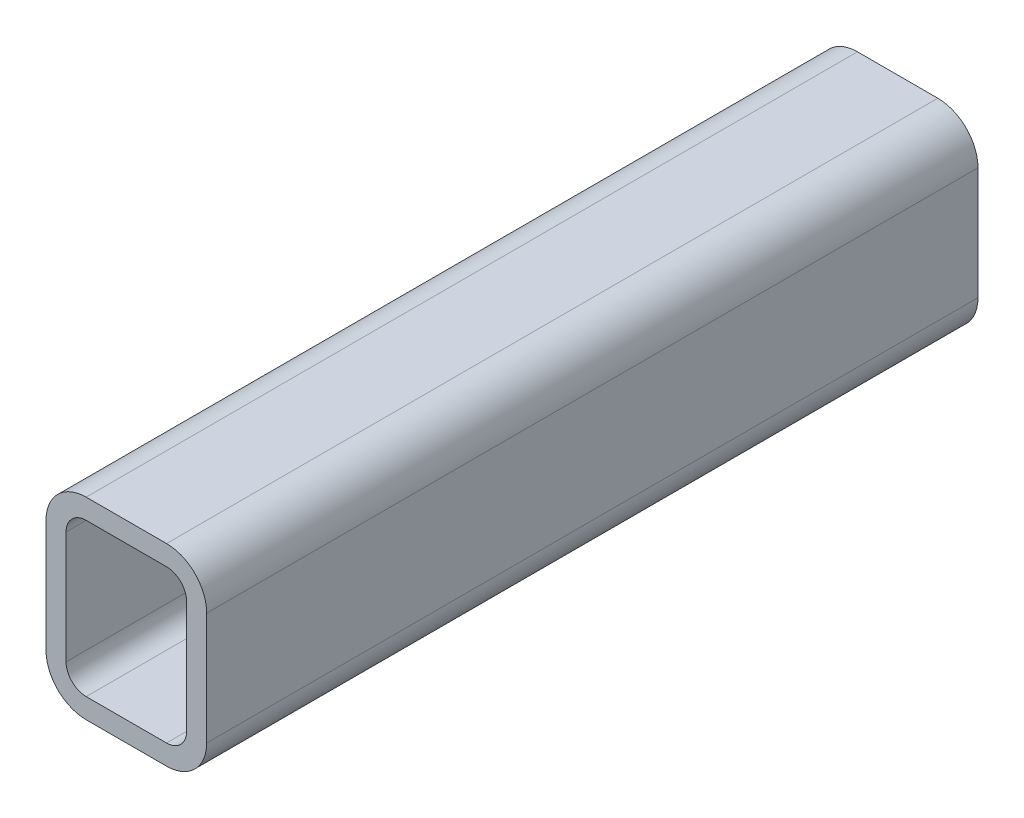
ISO-10303-21;
HEADER;
FILE_DESCRIPTION(('STEP AP214'),'2;1');
FILE_NAME('part.step','',(''),(''),'','','');
FILE_SCHEMA(('AUTOMOTIVE_DESIGN { 1 0 10303 214 1 1 1 1 }'));
ENDSEC;
DATA;
#1=APPLICATION_CONTEXT('core data for automotive mechanical design processes');
#2=APPLICATION_PROTOCOL_DEFINITION('international standard','automotive_design',2000,#1);
#3=PRODUCT_CONTEXT('',#1,'mechanical');
#4=PRODUCT('Part','Part','',(#3));
#5=PRODUCT_RELATED_PRODUCT_CATEGORY('part','',(#4));
#6=PRODUCT_DEFINITION_FORMATION('','',#4);
#7=PRODUCT_DEFINITION_CONTEXT('part definition',#1,'design');
#8=PRODUCT_DEFINITION('design','',#6,#7);
#9=PRODUCT_DEFINITION_SHAPE('','',#8);
#10=(LENGTH_UNIT() NAMED_UNIT(*) SI_UNIT(.MILLI.,.METRE.));
#11=(NAMED_UNIT(*) PLANE_ANGLE_UNIT() SI_UNIT($,.RADIAN.));
#12=(NAMED_UNIT(*) SI_UNIT($,.STERADIAN.) SOLID_ANGLE_UNIT());
#13=UNCERTAINTY_MEASURE_WITH_UNIT(LENGTH_MEASURE(1.E-05),#10,'distance_accuracy_value','');
#14=(GEOMETRIC_REPRESENTATION_CONTEXT(3) GLOBAL_UNCERTAINTY_ASSIGNED_CONTEXT((#13)) GLOBAL_UNIT_ASSIGNED_CONTEXT((#10,
#11,#12)) REPRESENTATION_CONTEXT('',''));
#15=CARTESIAN_POINT('',(0.,0.,0.));
#16=DIRECTION('',(0.,0.,1.));
#17=DIRECTION('',(1.,0.,0.));
#18=AXIS2_PLACEMENT_3D('',#15,#16,#17);
#19=CARTESIAN_POINT('',(18.7710851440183,62.4056737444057,304.8));
#20=DIRECTION('',(0.,0.,1.));
#21=DIRECTION('',(1.,0.,0.));
#22=AXIS2_PLACEMENT_3D('',#19,#20,#21);
#23=PLANE('',#22);
#24=CARTESIAN_POINT('',(18.7710851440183,62.4056737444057,304.8));
#25=DIRECTION('',(0.,0.,1.));
#26=DIRECTION('',(1.,0.,0.));
#27=AXIS2_PLACEMENT_3D('',#24,#25,#26);
#28=CIRCLE('',#27,15.875);
#29=CARTESIAN_POINT('',(18.7710851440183,78.2806737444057,304.8));
#30=VERTEX_POINT('',#29);
#31=CARTESIAN_POINT('',(2.89608514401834,62.4056737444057,304.8));
#32=VERTEX_POINT('',#31);
#33=EDGE_CURVE('E211',#30,#32,#28,.T.);
#34=ORIENTED_EDGE('',*,*,#33,.T.);
#35=DIRECTION('',(0.,-1.,0.));
#36=VECTOR('',#35,1.);
#37=CARTESIAN_POINT('',(2.89608514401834,17.9556737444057,304.8));
#38=LINE('',#37,#36);
#39=CARTESIAN_POINT('',(2.89608514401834,17.9556737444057,304.8));
#40=VERTEX_POINT('',#39);
#41=EDGE_CURVE('E214',#32,#40,#38,.T.);
#42=ORIENTED_EDGE('',*,*,#41,.T.);
#43=CARTESIAN_POINT('',(18.7710851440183,17.9556737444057,304.8));
#44=DIRECTION('',(0.,0.,1.));
#45=DIRECTION('',(1.,0.,0.));
#46=AXIS2_PLACEMENT_3D('',#43,#44,#45);
#47=CIRCLE('',#46,15.875);
#48=CARTESIAN_POINT('',(18.7710851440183,2.0806737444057,304.8));
#49=VERTEX_POINT('',#48);
#50=EDGE_CURVE('E217',#40,#49,#47,.T.);
#51=ORIENTED_EDGE('',*,*,#50,.T.);
#52=DIRECTION('',(1.,0.,0.));
#53=VECTOR('',#52,1.);
#54=CARTESIAN_POINT('',(50.5210851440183,2.0806737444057,304.8));
#55=LINE('',#54,#53);
#56=CARTESIAN_POINT('',(50.5210851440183,2.0806737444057,304.8));
#57=VERTEX_POINT('',#56);
#58=EDGE_CURVE('E219',#49,#57,#55,.T.);
#59=ORIENTED_EDGE('',*,*,#58,.T.);
#60=CARTESIAN_POINT('',(50.5210851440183,17.9556737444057,304.8));
#61=DIRECTION('',(0.,0.,1.));
#62=DIRECTION('',(1.,0.,0.));
#63=AXIS2_PLACEMENT_3D('',#60,#61,#62);
#64=CIRCLE('',#63,15.875);
#65=CARTESIAN_POINT('',(66.3960851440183,17.9556737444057,304.8));
#66=VERTEX_POINT('',#65);
#67=EDGE_CURVE('E221',#57,#66,#64,.T.);
#68=ORIENTED_EDGE('',*,*,#67,.T.);
#69=DIRECTION('',(0.,1.,0.));
#70=VECTOR('',#69,1.);
#71=CARTESIAN_POINT('',(66.3960851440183,62.4056737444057,304.8));
#72=LINE('',#71,#70);
#73=CARTESIAN_POINT('',(66.3960851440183,62.4056737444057,304.8));
#74=VERTEX_POINT('',#73);
#75=EDGE_CURVE('E223',#66,#74,#72,.T.);
#76=ORIENTED_EDGE('',*,*,#75,.T.);
#77=CARTESIAN_POINT('',(50.5210851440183,62.4056737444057,304.8));
#78=DIRECTION('',(0.,0.,1.));
#79=DIRECTION('',(1.,0.,0.));
#80=AXIS2_PLACEMENT_3D('',#77,#78,#79);
#81=CIRCLE('',#80,15.875);
#82=CARTESIAN_POINT('',(50.5210851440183,78.2806737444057,304.8));
#83=VERTEX_POINT('',#82);
#84=EDGE_CURVE('E225',#74,#83,#81,.T.);
#85=ORIENTED_EDGE('',*,*,#84,.T.);
#86=DIRECTION('',(-1.,0.,0.));
#87=VECTOR('',#86,1.);
#88=CARTESIAN_POINT('',(18.7710851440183,78.2806737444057,304.8));
#89=LINE('',#88,#87);
#90=EDGE_CURVE('E227',#83,#30,#89,.T.);
#91=ORIENTED_EDGE('',*,*,#90,.T.);
#92=EDGE_LOOP('',(#34,#42,#51,#59,#68,#76,#85,#91));
#93=FACE_BOUND('',#92,.T.);
#94=DIRECTION('',(0.,-1.,0.));
#95=VECTOR('',#94,1.);
#96=CARTESIAN_POINT('',(10.8335851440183,17.9556737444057,304.8));
#97=LINE('',#96,#95);
#98=CARTESIAN_POINT('',(10.8335851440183,62.4056737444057,304.8));
#99=VERTEX_POINT('',#98);
#100=CARTESIAN_POINT('',(10.8335851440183,17.9556737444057,304.8));
#101=VERTEX_POINT('',#100);
#102=EDGE_CURVE('E154',#99,#101,#97,.T.);
#103=ORIENTED_EDGE('',*,*,#102,.F.);
#104=CARTESIAN_POINT('',(18.7710851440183,62.4056737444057,304.8));
#105=DIRECTION('',(0.,0.,1.));
#106=DIRECTION('',(1.,0.,0.));
#107=AXIS2_PLACEMENT_3D('',#104,#105,#106);
#108=CIRCLE('',#107,7.9375);
#109=CARTESIAN_POINT('',(18.7710851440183,70.3431737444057,304.8));
#110=VERTEX_POINT('',#109);
#111=EDGE_CURVE('E146',#110,#99,#108,.T.);
#112=ORIENTED_EDGE('',*,*,#111,.F.);
#113=DIRECTION('',(-1.,0.,0.));
#114=VECTOR('',#113,1.);
#115=CARTESIAN_POINT('',(18.7710851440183,70.3431737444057,304.8));
#116=LINE('',#115,#114);
#117=CARTESIAN_POINT('',(50.5210851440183,70.3431737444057,304.8));
#118=VERTEX_POINT('',#117);
#119=EDGE_CURVE('E179',#118,#110,#116,.T.);
#120=ORIENTED_EDGE('',*,*,#119,.F.);
#121=CARTESIAN_POINT('',(50.5210851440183,62.4056737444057,304.8));
#122=DIRECTION('',(0.,0.,1.));
#123=DIRECTION('',(1.,0.,0.));
#124=AXIS2_PLACEMENT_3D('',#121,#122,#123);
#125=CIRCLE('',#124,7.93750000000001);
#126=CARTESIAN_POINT('',(58.4585851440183,62.4056737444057,304.8));
#127=VERTEX_POINT('',#126);
#128=EDGE_CURVE('E177',#127,#118,#125,.T.);
#129=ORIENTED_EDGE('',*,*,#128,.F.);
#130=DIRECTION('',(0.,1.,0.));
#131=VECTOR('',#130,1.);
#132=CARTESIAN_POINT('',(58.4585851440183,62.4056737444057,304.8));
#133=LINE('',#132,#131);
#134=CARTESIAN_POINT('',(58.4585851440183,17.9556737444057,304.8));
#135=VERTEX_POINT('',#134);
#136=EDGE_CURVE('E175',#135,#127,#133,.T.);
#137=ORIENTED_EDGE('',*,*,#136,.F.);
#138=CARTESIAN_POINT('',(50.5210851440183,17.9556737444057,304.8));
#139=DIRECTION('',(0.,0.,1.));
#140=DIRECTION('',(1.,0.,0.));
#141=AXIS2_PLACEMENT_3D('',#138,#139,#140);
#142=CIRCLE('',#141,7.93750000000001);
#143=CARTESIAN_POINT('',(50.5210851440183,10.0181737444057,304.8));
#144=VERTEX_POINT('',#143);
#145=EDGE_CURVE('E173',#144,#135,#142,.T.);
#146=ORIENTED_EDGE('',*,*,#145,.F.);
#147=DIRECTION('',(1.,0.,0.));
#148=VECTOR('',#147,1.);
#149=CARTESIAN_POINT('',(50.5210851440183,10.0181737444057,304.8));
#150=LINE('',#149,#148);
#151=CARTESIAN_POINT('',(18.7710851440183,10.0181737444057,304.8));
#152=VERTEX_POINT('',#151);
#153=EDGE_CURVE('E169',#152,#144,#150,.T.);
#154=ORIENTED_EDGE('',*,*,#153,.F.);
#155=CARTESIAN_POINT('',(18.7710851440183,17.9556737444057,304.8));
#156=DIRECTION('',(0.,0.,1.));
#157=DIRECTION('',(1.,0.,0.));
#158=AXIS2_PLACEMENT_3D('',#155,#156,#157);
#159=CIRCLE('',#158,7.9375);
#160=EDGE_CURVE('E167',#101,#152,#159,.T.);
#161=ORIENTED_EDGE('',*,*,#160,.F.);
#162=EDGE_LOOP('',(#103,#112,#120,#129,#137,#146,#154,#161));
#163=FACE_BOUND('',#162,.T.);
#164=ADVANCED_FACE('F33',(#93,#163),#23,.T.);
#165=CARTESIAN_POINT('',(18.7710851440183,62.4056737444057,0.));
#166=DIRECTION('',(0.,0.,1.));
#167=DIRECTION('',(1.,0.,0.));
#168=AXIS2_PLACEMENT_3D('',#165,#166,#167);
#169=PLANE('',#168);
#170=CARTESIAN_POINT('',(18.7710851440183,62.4056737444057,0.));
#171=DIRECTION('',(0.,0.,1.));
#172=DIRECTION('',(1.,0.,0.));
#173=AXIS2_PLACEMENT_3D('',#170,#171,#172);
#174=CIRCLE('',#173,15.875);
#175=CARTESIAN_POINT('',(18.7710851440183,78.2806737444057,0.));
#176=VERTEX_POINT('',#175);
#177=CARTESIAN_POINT('',(2.89608514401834,62.4056737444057,0.));
#178=VERTEX_POINT('',#177);
#179=EDGE_CURVE('E162',#176,#178,#174,.T.);
#180=ORIENTED_EDGE('',*,*,#179,.F.);
#181=DIRECTION('',(-1.,0.,0.));
#182=VECTOR('',#181,1.);
#183=CARTESIAN_POINT('',(18.7710851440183,78.2806737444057,0.));
#184=LINE('',#183,#182);
#185=CARTESIAN_POINT('',(50.5210851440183,78.2806737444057,0.));
#186=VERTEX_POINT('',#185);
#187=EDGE_CURVE('E215',#186,#176,#184,.T.);
#188=ORIENTED_EDGE('',*,*,#187,.F.);
#189=CARTESIAN_POINT('',(50.5210851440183,62.4056737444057,0.));
#190=DIRECTION('',(0.,0.,1.));
#191=DIRECTION('',(1.,0.,0.));
#192=AXIS2_PLACEMENT_3D('',#189,#190,#191);
#193=CIRCLE('',#192,15.875);
#194=CARTESIAN_POINT('',(66.3960851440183,62.4056737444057,0.));
#195=VERTEX_POINT('',#194);
#196=EDGE_CURVE('E242',#195,#186,#193,.T.);
#197=ORIENTED_EDGE('',*,*,#196,.F.);
#198=DIRECTION('',(0.,1.,0.));
#199=VECTOR('',#198,1.);
#200=CARTESIAN_POINT('',(66.3960851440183,62.4056737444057,0.));
#201=LINE('',#200,#199);
#202=CARTESIAN_POINT('',(66.3960851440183,17.9556737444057,0.));
#203=VERTEX_POINT('',#202);
#204=EDGE_CURVE('E240',#203,#195,#201,.T.);
#205=ORIENTED_EDGE('',*,*,#204,.F.);
#206=CARTESIAN_POINT('',(50.5210851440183,17.9556737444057,0.));
#207=DIRECTION('',(0.,0.,1.));
#208=DIRECTION('',(1.,0.,0.));
#209=AXIS2_PLACEMENT_3D('',#206,#207,#208);
#210=CIRCLE('',#209,15.875);
#211=CARTESIAN_POINT('',(50.5210851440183,2.0806737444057,0.));
#212=VERTEX_POINT('',#211);
#213=EDGE_CURVE('E238',#212,#203,#210,.T.);
#214=ORIENTED_EDGE('',*,*,#213,.F.);
#215=DIRECTION('',(1.,0.,0.));
#216=VECTOR('',#215,1.);
#217=CARTESIAN_POINT('',(50.5210851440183,2.0806737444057,0.));
#218=LINE('',#217,#216);
#219=CARTESIAN_POINT('',(18.7710851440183,2.0806737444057,0.));
#220=VERTEX_POINT('',#219);
#221=EDGE_CURVE('E236',#220,#212,#218,.T.);
#222=ORIENTED_EDGE('',*,*,#221,.F.);
#223=CARTESIAN_POINT('',(18.7710851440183,17.9556737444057,0.));
#224=DIRECTION('',(0.,0.,1.));
#225=DIRECTION('',(1.,0.,0.));
#226=AXIS2_PLACEMENT_3D('',#223,#224,#225);
#227=CIRCLE('',#226,15.875);
#228=CARTESIAN_POINT('',(2.89608514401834,17.9556737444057,0.));
#229=VERTEX_POINT('',#228);
#230=EDGE_CURVE('E234',#229,#220,#227,.T.);
#231=ORIENTED_EDGE('',*,*,#230,.F.);
#232=DIRECTION('',(0.,-1.,0.));
#233=VECTOR('',#232,1.);
#234=CARTESIAN_POINT('',(2.89608514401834,17.9556737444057,0.));
#235=LINE('',#234,#233);
#236=EDGE_CURVE('E232',#178,#229,#235,.T.);
#237=ORIENTED_EDGE('',*,*,#236,.F.);
#238=EDGE_LOOP('',(#180,#188,#197,#205,#214,#222,#231,#237));
#239=FACE_BOUND('',#238,.T.);
#240=CARTESIAN_POINT('',(18.7710851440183,62.4056737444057,0.));
#241=DIRECTION('',(0.,0.,1.));
#242=DIRECTION('',(1.,0.,0.));
#243=AXIS2_PLACEMENT_3D('',#240,#241,#242);
#244=CIRCLE('',#243,7.9375);
#245=CARTESIAN_POINT('',(18.7710851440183,70.3431737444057,0.));
#246=VERTEX_POINT('',#245);
#247=CARTESIAN_POINT('',(10.8335851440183,62.4056737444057,0.));
#248=VERTEX_POINT('',#247);
#249=EDGE_CURVE('E56',#246,#248,#244,.T.);
#250=ORIENTED_EDGE('',*,*,#249,.T.);
#251=DIRECTION('',(0.,-1.,0.));
#252=VECTOR('',#251,1.);
#253=CARTESIAN_POINT('',(10.8335851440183,17.9556737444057,0.));
#254=LINE('',#253,#252);
#255=CARTESIAN_POINT('',(10.8335851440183,17.9556737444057,0.));
#256=VERTEX_POINT('',#255);
#257=EDGE_CURVE('E161',#248,#256,#254,.T.);
#258=ORIENTED_EDGE('',*,*,#257,.T.);
#259=CARTESIAN_POINT('',(18.7710851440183,17.9556737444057,0.));
#260=DIRECTION('',(0.,0.,1.));
#261=DIRECTION('',(1.,0.,0.));
#262=AXIS2_PLACEMENT_3D('',#259,#260,#261);
#263=CIRCLE('',#262,7.9375);
#264=CARTESIAN_POINT('',(18.7710851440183,10.0181737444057,0.));
#265=VERTEX_POINT('',#264);
#266=EDGE_CURVE('E183',#256,#265,#263,.T.);
#267=ORIENTED_EDGE('',*,*,#266,.T.);
#268=DIRECTION('',(1.,0.,0.));
#269=VECTOR('',#268,1.);
#270=CARTESIAN_POINT('',(50.5210851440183,10.0181737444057,0.));
#271=LINE('',#270,#269);
#272=CARTESIAN_POINT('',(50.5210851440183,10.0181737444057,0.));
#273=VERTEX_POINT('',#272);
#274=EDGE_CURVE('E186',#265,#273,#271,.T.);
#275=ORIENTED_EDGE('',*,*,#274,.T.);
#276=CARTESIAN_POINT('',(50.5210851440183,17.9556737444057,0.));
#277=DIRECTION('',(0.,0.,1.));
#278=DIRECTION('',(1.,0.,0.));
#279=AXIS2_PLACEMENT_3D('',#276,#277,#278);
#280=CIRCLE('',#279,7.93750000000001);
#281=CARTESIAN_POINT('',(58.4585851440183,17.9556737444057,0.));
#282=VERTEX_POINT('',#281);
#283=EDGE_CURVE('E189',#273,#282,#280,.T.);
#284=ORIENTED_EDGE('',*,*,#283,.T.);
#285=DIRECTION('',(0.,1.,0.));
#286=VECTOR('',#285,1.);
#287=CARTESIAN_POINT('',(58.4585851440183,62.4056737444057,0.));
#288=LINE('',#287,#286);
#289=CARTESIAN_POINT('',(58.4585851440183,62.4056737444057,0.));
#290=VERTEX_POINT('',#289);
#291=EDGE_CURVE('E192',#282,#290,#288,.T.);
#292=ORIENTED_EDGE('',*,*,#291,.T.);
#293=CARTESIAN_POINT('',(50.5210851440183,62.4056737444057,0.));
#294=DIRECTION('',(0.,0.,1.));
#295=DIRECTION('',(1.,0.,0.));
#296=AXIS2_PLACEMENT_3D('',#293,#294,#295);
#297=CIRCLE('',#296,7.93750000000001);
#298=CARTESIAN_POINT('',(50.5210851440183,70.3431737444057,0.));
#299=VERTEX_POINT('',#298);
#300=EDGE_CURVE('E195',#290,#299,#297,.T.);
#301=ORIENTED_EDGE('',*,*,#300,.T.);
#302=DIRECTION('',(-1.,0.,0.));
#303=VECTOR('',#302,1.);
#304=CARTESIAN_POINT('',(18.7710851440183,70.3431737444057,0.));
#305=LINE('',#304,#303);
#306=EDGE_CURVE('E155',#299,#246,#305,.T.);
#307=ORIENTED_EDGE('',*,*,#306,.T.);
#308=EDGE_LOOP('',(#250,#258,#267,#275,#284,#292,#301,#307));
#309=FACE_BOUND('',#308,.T.);
#310=ADVANCED_FACE('F272',(#239,#309),#169,.F.);
#311=CARTESIAN_POINT('',(18.7710851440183,62.4056737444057,304.8));
#312=DIRECTION('',(0.,0.,-1.));
#313=DIRECTION('',(-1.,0.,0.));
#314=AXIS2_PLACEMENT_3D('',#311,#312,#313);
#315=CYLINDRICAL_SURFACE('',#314,15.875);
#316=ORIENTED_EDGE('',*,*,#179,.T.);
#317=DIRECTION('',(0.,0.,-1.));
#318=VECTOR('',#317,1.);
#319=CARTESIAN_POINT('',(2.89608514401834,62.4056737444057,304.8));
#320=LINE('',#319,#318);
#321=EDGE_CURVE('E11',#32,#178,#320,.T.);
#322=ORIENTED_EDGE('',*,*,#321,.F.);
#323=ORIENTED_EDGE('',*,*,#33,.F.);
#324=DIRECTION('',(0.,0.,-1.));
#325=VECTOR('',#324,1.);
#326=CARTESIAN_POINT('',(18.7710851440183,78.2806737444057,304.8));
#327=LINE('',#326,#325);
#328=EDGE_CURVE('E229',#30,#176,#327,.T.);
#329=ORIENTED_EDGE('',*,*,#328,.T.);
#330=EDGE_LOOP('',(#316,#322,#323,#329));
#331=FACE_BOUND('',#330,.T.);
#332=ADVANCED_FACE('F35',(#331),#315,.T.);
#333=CARTESIAN_POINT('',(2.89608514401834,17.9556737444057,304.8));
#334=DIRECTION('',(1.,0.,0.));
#335=DIRECTION('',(0.,0.,-1.));
#336=AXIS2_PLACEMENT_3D('',#333,#334,#335);
#337=PLANE('',#336);
#338=ORIENTED_EDGE('',*,*,#236,.T.);
#339=DIRECTION('',(0.,0.,-1.));
#340=VECTOR('',#339,1.);
#341=CARTESIAN_POINT('',(2.89608514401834,17.9556737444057,304.8));
#342=LINE('',#341,#340);
#343=EDGE_CURVE('E41',#40,#229,#342,.T.);
#344=ORIENTED_EDGE('',*,*,#343,.F.);
#345=ORIENTED_EDGE('',*,*,#41,.F.);
#346=ORIENTED_EDGE('',*,*,#321,.T.);
#347=EDGE_LOOP('',(#338,#344,#345,#346));
#348=FACE_BOUND('',#347,.T.);
#349=ADVANCED_FACE('F289',(#348),#337,.F.);
#350=CARTESIAN_POINT('',(18.7710851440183,17.9556737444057,304.8));
#351=DIRECTION('',(0.,0.,-1.));
#352=DIRECTION('',(-1.,0.,0.));
#353=AXIS2_PLACEMENT_3D('',#350,#351,#352);
#354=CYLINDRICAL_SURFACE('',#353,15.875);
#355=ORIENTED_EDGE('',*,*,#230,.T.);
#356=DIRECTION('',(0.,0.,-1.));
#357=VECTOR('',#356,1.);
#358=CARTESIAN_POINT('',(18.7710851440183,2.0806737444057,304.8));
#359=LINE('',#358,#357);
#360=EDGE_CURVE('E259',#49,#220,#359,.T.);
#361=ORIENTED_EDGE('',*,*,#360,.F.);
#362=ORIENTED_EDGE('',*,*,#50,.F.);
#363=ORIENTED_EDGE('',*,*,#343,.T.);
#364=EDGE_LOOP('',(#355,#361,#362,#363));
#365=FACE_BOUND('',#364,.T.);
#366=ADVANCED_FACE('F266',(#365),#354,.T.);
#367=CARTESIAN_POINT('',(50.5210851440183,2.0806737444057,304.8));
#368=DIRECTION('',(0.,1.,0.));
#369=DIRECTION('',(0.,0.,1.));
#370=AXIS2_PLACEMENT_3D('',#367,#368,#369);
#371=PLANE('',#370);
#372=ORIENTED_EDGE('',*,*,#221,.T.);
#373=DIRECTION('',(0.,0.,-1.));
#374=VECTOR('',#373,1.);
#375=CARTESIAN_POINT('',(50.5210851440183,2.0806737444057,304.8));
#376=LINE('',#375,#374);
#377=EDGE_CURVE('E256',#57,#212,#376,.T.);
#378=ORIENTED_EDGE('',*,*,#377,.F.);
#379=ORIENTED_EDGE('',*,*,#58,.F.);
#380=ORIENTED_EDGE('',*,*,#360,.T.);
#381=EDGE_LOOP('',(#372,#378,#379,#380));
#382=FACE_BOUND('',#381,.T.);
#383=ADVANCED_FACE('F278',(#382),#371,.F.);
#384=CARTESIAN_POINT('',(50.5210851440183,17.9556737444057,304.8));
#385=DIRECTION('',(0.,0.,-1.));
#386=DIRECTION('',(-1.,0.,0.));
#387=AXIS2_PLACEMENT_3D('',#384,#385,#386);
#388=CYLINDRICAL_SURFACE('',#387,15.875);
#389=ORIENTED_EDGE('',*,*,#213,.T.);
#390=DIRECTION('',(0.,0.,-1.));
#391=VECTOR('',#390,1.);
#392=CARTESIAN_POINT('',(66.3960851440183,17.9556737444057,304.8));
#393=LINE('',#392,#391);
#394=EDGE_CURVE('E253',#66,#203,#393,.T.);
#395=ORIENTED_EDGE('',*,*,#394,.F.);
#396=ORIENTED_EDGE('',*,*,#67,.F.);
#397=ORIENTED_EDGE('',*,*,#377,.T.);
#398=EDGE_LOOP('',(#389,#395,#396,#397));
#399=FACE_BOUND('',#398,.T.);
#400=ADVANCED_FACE('F282',(#399),#388,.T.);
#401=CARTESIAN_POINT('',(66.3960851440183,62.4056737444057,304.8));
#402=DIRECTION('',(-1.,0.,0.));
#403=DIRECTION('',(0.,0.,1.));
#404=AXIS2_PLACEMENT_3D('',#401,#402,#403);
#405=PLANE('',#404);
#406=ORIENTED_EDGE('',*,*,#204,.T.);
#407=DIRECTION('',(0.,0.,-1.));
#408=VECTOR('',#407,1.);
#409=CARTESIAN_POINT('',(66.3960851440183,62.4056737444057,304.8));
#410=LINE('',#409,#408);
#411=EDGE_CURVE('E250',#74,#195,#410,.T.);
#412=ORIENTED_EDGE('',*,*,#411,.F.);
#413=ORIENTED_EDGE('',*,*,#75,.F.);
#414=ORIENTED_EDGE('',*,*,#394,.T.);
#415=EDGE_LOOP('',(#406,#412,#413,#414));
#416=FACE_BOUND('',#415,.T.);
#417=ADVANCED_FACE('F302',(#416),#405,.F.);
#418=CARTESIAN_POINT('',(50.5210851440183,62.4056737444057,304.8));
#419=DIRECTION('',(0.,0.,-1.));
#420=DIRECTION('',(-1.,0.,0.));
#421=AXIS2_PLACEMENT_3D('',#418,#419,#420);
#422=CYLINDRICAL_SURFACE('',#421,15.875);
#423=ORIENTED_EDGE('',*,*,#196,.T.);
#424=DIRECTION('',(0.,0.,-1.));
#425=VECTOR('',#424,1.);
#426=CARTESIAN_POINT('',(50.5210851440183,78.2806737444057,304.8));
#427=LINE('',#426,#425);
#428=EDGE_CURVE('E247',#83,#186,#427,.T.);
#429=ORIENTED_EDGE('',*,*,#428,.F.);
#430=ORIENTED_EDGE('',*,*,#84,.F.);
#431=ORIENTED_EDGE('',*,*,#411,.T.);
#432=EDGE_LOOP('',(#423,#429,#430,#431));
#433=FACE_BOUND('',#432,.T.);
#434=ADVANCED_FACE('F300',(#433),#422,.T.);
#435=CARTESIAN_POINT('',(18.7710851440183,78.2806737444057,304.8));
#436=DIRECTION('',(0.,-1.,0.));
#437=DIRECTION('',(0.,0.,-1.));
#438=AXIS2_PLACEMENT_3D('',#435,#436,#437);
#439=PLANE('',#438);
#440=ORIENTED_EDGE('',*,*,#187,.T.);
#441=ORIENTED_EDGE('',*,*,#328,.F.);
#442=ORIENTED_EDGE('',*,*,#90,.F.);
#443=ORIENTED_EDGE('',*,*,#428,.T.);
#444=EDGE_LOOP('',(#440,#441,#442,#443));
#445=FACE_BOUND('',#444,.T.);
#446=ADVANCED_FACE('F295',(#445),#439,.F.);
#447=CARTESIAN_POINT('',(18.7710851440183,62.4056737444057,304.8));
#448=DIRECTION('',(0.,0.,-1.));
#449=DIRECTION('',(-1.,0.,0.));
#450=AXIS2_PLACEMENT_3D('',#447,#448,#449);
#451=CYLINDRICAL_SURFACE('',#450,7.9375);
#452=ORIENTED_EDGE('',*,*,#249,.F.);
#453=DIRECTION('',(0.,0.,-1.));
#454=VECTOR('',#453,1.);
#455=CARTESIAN_POINT('',(18.7710851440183,70.3431737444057,304.8));
#456=LINE('',#455,#454);
#457=EDGE_CURVE('E150',#110,#246,#456,.T.);
#458=ORIENTED_EDGE('',*,*,#457,.F.);
#459=ORIENTED_EDGE('',*,*,#111,.T.);
#460=DIRECTION('',(0.,0.,-1.));
#461=VECTOR('',#460,1.);
#462=CARTESIAN_POINT('',(10.8335851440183,62.4056737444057,304.8));
#463=LINE('',#462,#461);
#464=EDGE_CURVE('E149',#99,#248,#463,.T.);
#465=ORIENTED_EDGE('',*,*,#464,.T.);
#466=EDGE_LOOP('',(#452,#458,#459,#465));
#467=FACE_BOUND('',#466,.T.);
#468=ADVANCED_FACE('F148',(#467),#451,.F.);
#469=CARTESIAN_POINT('',(10.8335851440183,17.9556737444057,304.8));
#470=DIRECTION('',(1.,0.,0.));
#471=DIRECTION('',(0.,0.,-1.));
#472=AXIS2_PLACEMENT_3D('',#469,#470,#471);
#473=PLANE('',#472);
#474=ORIENTED_EDGE('',*,*,#257,.F.);
#475=ORIENTED_EDGE('',*,*,#464,.F.);
#476=ORIENTED_EDGE('',*,*,#102,.T.);
#477=DIRECTION('',(0.,0.,-1.));
#478=VECTOR('',#477,1.);
#479=CARTESIAN_POINT('',(10.8335851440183,17.9556737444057,304.8));
#480=LINE('',#479,#478);
#481=EDGE_CURVE('E163',#101,#256,#480,.T.);
#482=ORIENTED_EDGE('',*,*,#481,.T.);
#483=EDGE_LOOP('',(#474,#475,#476,#482));
#484=FACE_BOUND('',#483,.T.);
#485=ADVANCED_FACE('F158',(#484),#473,.T.);
#486=CARTESIAN_POINT('',(18.7710851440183,17.9556737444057,304.8));
#487=DIRECTION('',(0.,0.,-1.));
#488=DIRECTION('',(-1.,0.,0.));
#489=AXIS2_PLACEMENT_3D('',#486,#487,#488);
#490=CYLINDRICAL_SURFACE('',#489,7.9375);
#491=ORIENTED_EDGE('',*,*,#266,.F.);
#492=ORIENTED_EDGE('',*,*,#481,.F.);
#493=ORIENTED_EDGE('',*,*,#160,.T.);
#494=DIRECTION('',(0.,0.,-1.));
#495=VECTOR('',#494,1.);
#496=CARTESIAN_POINT('',(18.7710851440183,10.0181737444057,304.8));
#497=LINE('',#496,#495);
#498=EDGE_CURVE('E208',#152,#265,#497,.T.);
#499=ORIENTED_EDGE('',*,*,#498,.T.);
#500=EDGE_LOOP('',(#491,#492,#493,#499));
#501=FACE_BOUND('',#500,.T.);
#502=ADVANCED_FACE('F327',(#501),#490,.F.);
#503=CARTESIAN_POINT('',(50.5210851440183,10.0181737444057,304.8));
#504=DIRECTION('',(0.,1.,0.));
#505=DIRECTION('',(0.,0.,1.));
#506=AXIS2_PLACEMENT_3D('',#503,#504,#505);
#507=PLANE('',#506);
#508=ORIENTED_EDGE('',*,*,#274,.F.);
#509=ORIENTED_EDGE('',*,*,#498,.F.);
#510=ORIENTED_EDGE('',*,*,#153,.T.);
#511=DIRECTION('',(0.,0.,-1.));
#512=VECTOR('',#511,1.);
#513=CARTESIAN_POINT('',(50.5210851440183,10.0181737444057,304.8));
#514=LINE('',#513,#512);
#515=EDGE_CURVE('E206',#144,#273,#514,.T.);
#516=ORIENTED_EDGE('',*,*,#515,.T.);
#517=EDGE_LOOP('',(#508,#509,#510,#516));
#518=FACE_BOUND('',#517,.T.);
#519=ADVANCED_FACE('F331',(#518),#507,.T.);
#520=CARTESIAN_POINT('',(50.5210851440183,17.9556737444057,304.8));
#521=DIRECTION('',(0.,0.,-1.));
#522=DIRECTION('',(-1.,0.,0.));
#523=AXIS2_PLACEMENT_3D('',#520,#521,#522);
#524=CYLINDRICAL_SURFACE('',#523,7.93750000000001);
#525=ORIENTED_EDGE('',*,*,#283,.F.);
#526=ORIENTED_EDGE('',*,*,#515,.F.);
#527=ORIENTED_EDGE('',*,*,#145,.T.);
#528=DIRECTION('',(0.,0.,-1.));
#529=VECTOR('',#528,1.);
#530=CARTESIAN_POINT('',(58.4585851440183,17.9556737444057,304.8));
#531=LINE('',#530,#529);
#532=EDGE_CURVE('E204',#135,#282,#531,.T.);
#533=ORIENTED_EDGE('',*,*,#532,.T.);
#534=EDGE_LOOP('',(#525,#526,#527,#533));
#535=FACE_BOUND('',#534,.T.);
#536=ADVANCED_FACE('F337',(#535),#524,.F.);
#537=CARTESIAN_POINT('',(58.4585851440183,62.4056737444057,304.8));
#538=DIRECTION('',(-1.,0.,0.));
#539=DIRECTION('',(0.,0.,1.));
#540=AXIS2_PLACEMENT_3D('',#537,#538,#539);
#541=PLANE('',#540);
#542=ORIENTED_EDGE('',*,*,#291,.F.);
#543=ORIENTED_EDGE('',*,*,#532,.F.);
#544=ORIENTED_EDGE('',*,*,#136,.T.);
#545=DIRECTION('',(0.,0.,-1.));
#546=VECTOR('',#545,1.);
#547=CARTESIAN_POINT('',(58.4585851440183,62.4056737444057,304.8));
#548=LINE('',#547,#546);
#549=EDGE_CURVE('E202',#127,#290,#548,.T.);
#550=ORIENTED_EDGE('',*,*,#549,.T.);
#551=EDGE_LOOP('',(#542,#543,#544,#550));
#552=FACE_BOUND('',#551,.T.);
#553=ADVANCED_FACE('F341',(#552),#541,.T.);
#554=CARTESIAN_POINT('',(50.5210851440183,62.4056737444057,304.8));
#555=DIRECTION('',(0.,0.,-1.));
#556=DIRECTION('',(-1.,0.,0.));
#557=AXIS2_PLACEMENT_3D('',#554,#555,#556);
#558=CYLINDRICAL_SURFACE('',#557,7.93750000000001);
#559=ORIENTED_EDGE('',*,*,#300,.F.);
#560=ORIENTED_EDGE('',*,*,#549,.F.);
#561=ORIENTED_EDGE('',*,*,#128,.T.);
#562=DIRECTION('',(0.,0.,-1.));
#563=VECTOR('',#562,1.);
#564=CARTESIAN_POINT('',(50.5210851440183,70.3431737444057,304.8));
#565=LINE('',#564,#563);
#566=EDGE_CURVE('E48',#118,#299,#565,.T.);
#567=ORIENTED_EDGE('',*,*,#566,.T.);
#568=EDGE_LOOP('',(#559,#560,#561,#567));
#569=FACE_BOUND('',#568,.T.);
#570=ADVANCED_FACE('F345',(#569),#558,.F.);
#571=CARTESIAN_POINT('',(18.7710851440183,70.3431737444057,304.8));
#572=DIRECTION('',(0.,-1.,0.));
#573=DIRECTION('',(0.,0.,-1.));
#574=AXIS2_PLACEMENT_3D('',#571,#572,#573);
#575=PLANE('',#574);
#576=ORIENTED_EDGE('',*,*,#306,.F.);
#577=ORIENTED_EDGE('',*,*,#566,.F.);
#578=ORIENTED_EDGE('',*,*,#119,.T.);
#579=ORIENTED_EDGE('',*,*,#457,.T.);
#580=EDGE_LOOP('',(#576,#577,#578,#579));
#581=FACE_BOUND('',#580,.T.);
#582=ADVANCED_FACE('F349',(#581),#575,.T.);
#583=CLOSED_SHELL('',(#164,#310,#332,#349,#366,#383,#400,#417,#434,#446,#468,#485,#502,#519,
#536,#553,#570,#582));
#584=MANIFOLD_SOLID_BREP('B2',#583);
#585=ADVANCED_BREP_SHAPE_REPRESENTATION('',(#18,#584),#14);
#586=SHAPE_DEFINITION_REPRESENTATION(#9,#585);
ENDSEC;
END-ISO-10303-21;
